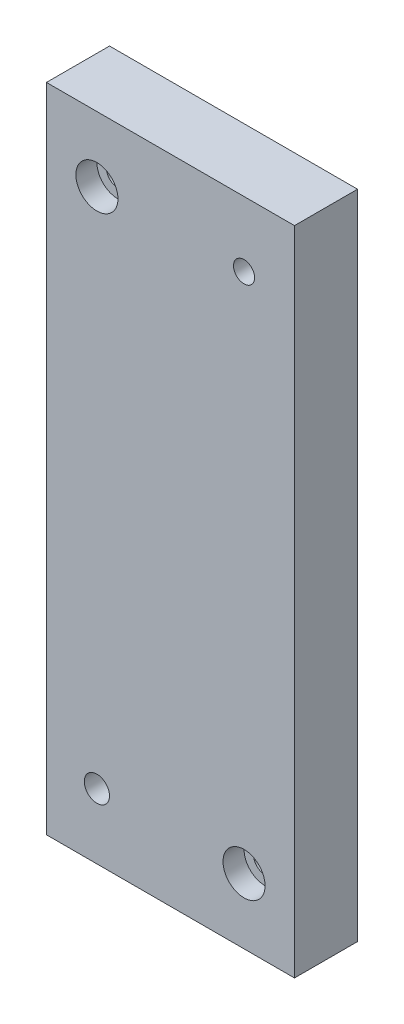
ISO-10303-21;
HEADER;
FILE_DESCRIPTION(('STEP AP214'),'2;1');
FILE_NAME('part.step','',(''),(''),'','','');
FILE_SCHEMA(('AUTOMOTIVE_DESIGN { 1 0 10303 214 1 1 1 1 }'));
ENDSEC;
DATA;
#1=APPLICATION_CONTEXT('core data for automotive mechanical design processes');
#2=APPLICATION_PROTOCOL_DEFINITION('international standard','automotive_design',2000,#1);
#3=PRODUCT_CONTEXT('',#1,'mechanical');
#4=PRODUCT('Part','Part','',(#3));
#5=PRODUCT_RELATED_PRODUCT_CATEGORY('part','',(#4));
#6=PRODUCT_DEFINITION_FORMATION('','',#4);
#7=PRODUCT_DEFINITION_CONTEXT('part definition',#1,'design');
#8=PRODUCT_DEFINITION('design','',#6,#7);
#9=PRODUCT_DEFINITION_SHAPE('','',#8);
#10=(LENGTH_UNIT() NAMED_UNIT(*) SI_UNIT(.MILLI.,.METRE.));
#11=(NAMED_UNIT(*) PLANE_ANGLE_UNIT() SI_UNIT($,.RADIAN.));
#12=(NAMED_UNIT(*) SI_UNIT($,.STERADIAN.) SOLID_ANGLE_UNIT());
#13=UNCERTAINTY_MEASURE_WITH_UNIT(LENGTH_MEASURE(1.E-05),#10,'distance_accuracy_value','');
#14=(GEOMETRIC_REPRESENTATION_CONTEXT(3) GLOBAL_UNCERTAINTY_ASSIGNED_CONTEXT((#13)) GLOBAL_UNIT_ASSIGNED_CONTEXT((#10,
#11,#12)) REPRESENTATION_CONTEXT('',''));
#15=CARTESIAN_POINT('',(0.,0.,0.));
#16=DIRECTION('',(0.,0.,1.));
#17=DIRECTION('',(1.,0.,0.));
#18=AXIS2_PLACEMENT_3D('',#15,#16,#17);
#19=CARTESIAN_POINT('',(-29.5,-77.5,15.));
#20=DIRECTION('',(0.,0.,1.));
#21=DIRECTION('',(1.,0.,0.));
#22=AXIS2_PLACEMENT_3D('',#19,#20,#21);
#23=PLANE('',#22);
#24=CARTESIAN_POINT('',(-17.4999999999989,61.9999999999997,15.));
#25=DIRECTION('',(0.,0.,1.));
#26=DIRECTION('',(1.,0.,0.));
#27=AXIS2_PLACEMENT_3D('',#24,#25,#26);
#28=CIRCLE('',#27,5.);
#29=CARTESIAN_POINT('',(-12.4999999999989,61.9999999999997,15.));
#30=VERTEX_POINT('',#29);
#31=EDGE_CURVE('E138',#30,#30,#28,.T.);
#32=ORIENTED_EDGE('',*,*,#31,.F.);
#33=EDGE_LOOP('',(#32));
#34=FACE_BOUND('',#33,.T.);
#35=CARTESIAN_POINT('',(17.5000000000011,-62.0000000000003,15.));
#36=DIRECTION('',(0.,0.,1.));
#37=DIRECTION('',(1.,0.,0.));
#38=AXIS2_PLACEMENT_3D('',#35,#36,#37);
#39=CIRCLE('',#38,5.);
#40=CARTESIAN_POINT('',(22.5000000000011,-62.0000000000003,15.));
#41=VERTEX_POINT('',#40);
#42=EDGE_CURVE('E124',#41,#41,#39,.T.);
#43=ORIENTED_EDGE('',*,*,#42,.F.);
#44=EDGE_LOOP('',(#43));
#45=FACE_BOUND('',#44,.T.);
#46=CARTESIAN_POINT('',(-17.4999999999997,-62.,15.));
#47=DIRECTION('',(0.,0.,1.));
#48=DIRECTION('',(1.,0.,0.));
#49=AXIS2_PLACEMENT_3D('',#46,#47,#48);
#50=CIRCLE('',#49,3.00349999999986);
#51=CARTESIAN_POINT('',(-14.4964999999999,-62.,15.));
#52=VERTEX_POINT('',#51);
#53=EDGE_CURVE('E90',#52,#52,#50,.T.);
#54=ORIENTED_EDGE('',*,*,#53,.F.);
#55=EDGE_LOOP('',(#54));
#56=FACE_BOUND('',#55,.T.);
#57=DIRECTION('',(1.,0.,0.));
#58=VECTOR('',#57,1.);
#59=CARTESIAN_POINT('',(-29.5,-77.5,15.));
#60=LINE('',#59,#58);
#61=CARTESIAN_POINT('',(-29.5,-77.5,15.));
#62=VERTEX_POINT('',#61);
#63=CARTESIAN_POINT('',(29.5,-77.5,15.));
#64=VERTEX_POINT('',#63);
#65=EDGE_CURVE('E100',#62,#64,#60,.T.);
#66=ORIENTED_EDGE('',*,*,#65,.T.);
#67=DIRECTION('',(0.,1.,0.));
#68=VECTOR('',#67,1.);
#69=CARTESIAN_POINT('',(29.5,-77.5,15.));
#70=LINE('',#69,#68);
#71=CARTESIAN_POINT('',(29.5,77.5,15.));
#72=VERTEX_POINT('',#71);
#73=EDGE_CURVE('E85',#64,#72,#70,.T.);
#74=ORIENTED_EDGE('',*,*,#73,.T.);
#75=DIRECTION('',(-1.,0.,0.));
#76=VECTOR('',#75,1.);
#77=CARTESIAN_POINT('',(29.5,77.5,15.));
#78=LINE('',#77,#76);
#79=CARTESIAN_POINT('',(-29.5,77.5,15.));
#80=VERTEX_POINT('',#79);
#81=EDGE_CURVE('E51',#72,#80,#78,.T.);
#82=ORIENTED_EDGE('',*,*,#81,.T.);
#83=DIRECTION('',(0.,-1.,0.));
#84=VECTOR('',#83,1.);
#85=CARTESIAN_POINT('',(-29.5,-77.5,15.));
#86=LINE('',#85,#84);
#87=EDGE_CURVE('E46',#80,#62,#86,.T.);
#88=ORIENTED_EDGE('',*,*,#87,.T.);
#89=EDGE_LOOP('',(#66,#74,#82,#88));
#90=FACE_BOUND('',#89,.T.);
#91=CARTESIAN_POINT('',(17.5000000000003,62.,15.));
#92=DIRECTION('',(0.,0.,1.));
#93=DIRECTION('',(1.,0.,0.));
#94=AXIS2_PLACEMENT_3D('',#91,#92,#93);
#95=CIRCLE('',#94,2.50349999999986);
#96=CARTESIAN_POINT('',(20.0035000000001,62.,15.));
#97=VERTEX_POINT('',#96);
#98=EDGE_CURVE('E118',#97,#97,#95,.T.);
#99=ORIENTED_EDGE('',*,*,#98,.F.);
#100=EDGE_LOOP('',(#99));
#101=FACE_BOUND('',#100,.T.);
#102=ADVANCED_FACE('F31',(#34,#45,#56,#90,#101),#23,.T.);
#103=CARTESIAN_POINT('',(-29.5,-77.5,0.));
#104=DIRECTION('',(0.,0.,1.));
#105=DIRECTION('',(1.,0.,0.));
#106=AXIS2_PLACEMENT_3D('',#103,#104,#105);
#107=PLANE('',#106);
#108=CARTESIAN_POINT('',(-17.4999999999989,61.9999999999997,0.));
#109=DIRECTION('',(0.,0.,1.));
#110=DIRECTION('',(1.,0.,0.));
#111=AXIS2_PLACEMENT_3D('',#108,#109,#110);
#112=CIRCLE('',#111,2.75);
#113=CARTESIAN_POINT('',(-14.7499999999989,61.9999999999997,0.));
#114=VERTEX_POINT('',#113);
#115=EDGE_CURVE('E147',#114,#114,#112,.T.);
#116=ORIENTED_EDGE('',*,*,#115,.T.);
#117=EDGE_LOOP('',(#116));
#118=FACE_BOUND('',#117,.T.);
#119=CARTESIAN_POINT('',(17.5000000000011,-62.0000000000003,0.));
#120=DIRECTION('',(0.,0.,1.));
#121=DIRECTION('',(1.,0.,0.));
#122=AXIS2_PLACEMENT_3D('',#119,#120,#121);
#123=CIRCLE('',#122,2.75);
#124=CARTESIAN_POINT('',(20.2500000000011,-62.0000000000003,0.));
#125=VERTEX_POINT('',#124);
#126=EDGE_CURVE('E135',#125,#125,#123,.T.);
#127=ORIENTED_EDGE('',*,*,#126,.T.);
#128=EDGE_LOOP('',(#127));
#129=FACE_BOUND('',#128,.T.);
#130=CARTESIAN_POINT('',(-17.4999999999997,-62.,0.));
#131=DIRECTION('',(0.,0.,1.));
#132=DIRECTION('',(1.,0.,0.));
#133=AXIS2_PLACEMENT_3D('',#130,#131,#132);
#134=CIRCLE('',#133,3.00349999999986);
#135=CARTESIAN_POINT('',(-14.4964999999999,-62.,0.));
#136=VERTEX_POINT('',#135);
#137=EDGE_CURVE('E93',#136,#136,#134,.T.);
#138=ORIENTED_EDGE('',*,*,#137,.T.);
#139=EDGE_LOOP('',(#138));
#140=FACE_BOUND('',#139,.T.);
#141=DIRECTION('',(1.,0.,0.));
#142=VECTOR('',#141,1.);
#143=CARTESIAN_POINT('',(-29.5,-77.5,0.));
#144=LINE('',#143,#142);
#145=CARTESIAN_POINT('',(-29.5,-77.5,0.));
#146=VERTEX_POINT('',#145);
#147=CARTESIAN_POINT('',(29.5,-77.5,0.));
#148=VERTEX_POINT('',#147);
#149=EDGE_CURVE('E77',#146,#148,#144,.T.);
#150=ORIENTED_EDGE('',*,*,#149,.F.);
#151=DIRECTION('',(0.,-1.,0.));
#152=VECTOR('',#151,1.);
#153=CARTESIAN_POINT('',(-29.5,-77.5,0.));
#154=LINE('',#153,#152);
#155=CARTESIAN_POINT('',(-29.5,77.5,0.));
#156=VERTEX_POINT('',#155);
#157=EDGE_CURVE('E98',#156,#146,#154,.T.);
#158=ORIENTED_EDGE('',*,*,#157,.F.);
#159=DIRECTION('',(-1.,0.,0.));
#160=VECTOR('',#159,1.);
#161=CARTESIAN_POINT('',(29.5,77.5,0.));
#162=LINE('',#161,#160);
#163=CARTESIAN_POINT('',(29.5,77.5,0.));
#164=VERTEX_POINT('',#163);
#165=EDGE_CURVE('E78',#164,#156,#162,.T.);
#166=ORIENTED_EDGE('',*,*,#165,.F.);
#167=DIRECTION('',(0.,1.,0.));
#168=VECTOR('',#167,1.);
#169=CARTESIAN_POINT('',(29.5,-77.5,0.));
#170=LINE('',#169,#168);
#171=EDGE_CURVE('E72',#148,#164,#170,.T.);
#172=ORIENTED_EDGE('',*,*,#171,.F.);
#173=EDGE_LOOP('',(#150,#158,#166,#172));
#174=FACE_BOUND('',#173,.T.);
#175=CARTESIAN_POINT('',(17.5000000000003,62.,0.));
#176=DIRECTION('',(0.,0.,1.));
#177=DIRECTION('',(1.,0.,0.));
#178=AXIS2_PLACEMENT_3D('',#175,#176,#177);
#179=CIRCLE('',#178,2.50349999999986);
#180=CARTESIAN_POINT('',(20.0035000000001,62.,0.));
#181=VERTEX_POINT('',#180);
#182=EDGE_CURVE('E120',#181,#181,#179,.T.);
#183=ORIENTED_EDGE('',*,*,#182,.T.);
#184=EDGE_LOOP('',(#183));
#185=FACE_BOUND('',#184,.T.);
#186=ADVANCED_FACE('F73',(#118,#129,#140,#174,#185),#107,.F.);
#187=CARTESIAN_POINT('',(-29.5,-77.5,15.));
#188=DIRECTION('',(0.,1.,0.));
#189=DIRECTION('',(-1.,0.,0.));
#190=AXIS2_PLACEMENT_3D('',#187,#188,#189);
#191=PLANE('',#190);
#192=ORIENTED_EDGE('',*,*,#149,.T.);
#193=DIRECTION('',(0.,0.,-1.));
#194=VECTOR('',#193,1.);
#195=CARTESIAN_POINT('',(29.5,-77.5,15.));
#196=LINE('',#195,#194);
#197=EDGE_CURVE('E11',#64,#148,#196,.T.);
#198=ORIENTED_EDGE('',*,*,#197,.F.);
#199=ORIENTED_EDGE('',*,*,#65,.F.);
#200=DIRECTION('',(0.,0.,-1.));
#201=VECTOR('',#200,1.);
#202=CARTESIAN_POINT('',(-29.5,-77.5,15.));
#203=LINE('',#202,#201);
#204=EDGE_CURVE('E89',#62,#146,#203,.T.);
#205=ORIENTED_EDGE('',*,*,#204,.T.);
#206=EDGE_LOOP('',(#192,#198,#199,#205));
#207=FACE_BOUND('',#206,.T.);
#208=ADVANCED_FACE('F33',(#207),#191,.F.);
#209=CARTESIAN_POINT('',(29.5,-77.5,15.));
#210=DIRECTION('',(-1.,0.,0.));
#211=DIRECTION('',(0.,-1.,0.));
#212=AXIS2_PLACEMENT_3D('',#209,#210,#211);
#213=PLANE('',#212);
#214=ORIENTED_EDGE('',*,*,#171,.T.);
#215=DIRECTION('',(0.,0.,-1.));
#216=VECTOR('',#215,1.);
#217=CARTESIAN_POINT('',(29.5,77.5,15.));
#218=LINE('',#217,#216);
#219=EDGE_CURVE('E39',#72,#164,#218,.T.);
#220=ORIENTED_EDGE('',*,*,#219,.F.);
#221=ORIENTED_EDGE('',*,*,#73,.F.);
#222=ORIENTED_EDGE('',*,*,#197,.T.);
#223=EDGE_LOOP('',(#214,#220,#221,#222));
#224=FACE_BOUND('',#223,.T.);
#225=ADVANCED_FACE('F84',(#224),#213,.F.);
#226=CARTESIAN_POINT('',(29.5,77.5,15.));
#227=DIRECTION('',(0.,-1.,0.));
#228=DIRECTION('',(1.,0.,0.));
#229=AXIS2_PLACEMENT_3D('',#226,#227,#228);
#230=PLANE('',#229);
#231=ORIENTED_EDGE('',*,*,#165,.T.);
#232=DIRECTION('',(0.,0.,-1.));
#233=VECTOR('',#232,1.);
#234=CARTESIAN_POINT('',(-29.5,77.5,15.));
#235=LINE('',#234,#233);
#236=EDGE_CURVE('E106',#80,#156,#235,.T.);
#237=ORIENTED_EDGE('',*,*,#236,.F.);
#238=ORIENTED_EDGE('',*,*,#81,.F.);
#239=ORIENTED_EDGE('',*,*,#219,.T.);
#240=EDGE_LOOP('',(#231,#237,#238,#239));
#241=FACE_BOUND('',#240,.T.);
#242=ADVANCED_FACE('F109',(#241),#230,.F.);
#243=CARTESIAN_POINT('',(-29.5,-77.5,15.));
#244=DIRECTION('',(1.,0.,0.));
#245=DIRECTION('',(0.,1.,0.));
#246=AXIS2_PLACEMENT_3D('',#243,#244,#245);
#247=PLANE('',#246);
#248=ORIENTED_EDGE('',*,*,#157,.T.);
#249=ORIENTED_EDGE('',*,*,#204,.F.);
#250=ORIENTED_EDGE('',*,*,#87,.F.);
#251=ORIENTED_EDGE('',*,*,#236,.T.);
#252=EDGE_LOOP('',(#248,#249,#250,#251));
#253=FACE_BOUND('',#252,.T.);
#254=ADVANCED_FACE('F111',(#253),#247,.F.);
#255=CARTESIAN_POINT('',(-17.4999999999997,-62.,15.));
#256=DIRECTION('',(0.,0.,-1.));
#257=DIRECTION('',(-1.,0.,0.));
#258=AXIS2_PLACEMENT_3D('',#255,#256,#257);
#259=CYLINDRICAL_SURFACE('',#258,3.00349999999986);
#260=ORIENTED_EDGE('',*,*,#53,.T.);
#261=EDGE_LOOP('',(#260));
#262=FACE_BOUND('',#261,.T.);
#263=ORIENTED_EDGE('',*,*,#137,.F.);
#264=EDGE_LOOP('',(#263));
#265=FACE_BOUND('',#264,.T.);
#266=ADVANCED_FACE('F176',(#262,#265),#259,.F.);
#267=CARTESIAN_POINT('',(17.5000000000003,62.,15.));
#268=DIRECTION('',(0.,0.,-1.));
#269=DIRECTION('',(-1.,0.,0.));
#270=AXIS2_PLACEMENT_3D('',#267,#268,#269);
#271=CYLINDRICAL_SURFACE('',#270,2.50349999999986);
#272=ORIENTED_EDGE('',*,*,#98,.T.);
#273=EDGE_LOOP('',(#272));
#274=FACE_BOUND('',#273,.T.);
#275=ORIENTED_EDGE('',*,*,#182,.F.);
#276=EDGE_LOOP('',(#275));
#277=FACE_BOUND('',#276,.T.);
#278=ADVANCED_FACE('F179',(#274,#277),#271,.F.);
#279=CARTESIAN_POINT('',(17.5000000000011,-62.0000000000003,15.));
#280=DIRECTION('',(0.,0.,1.));
#281=DIRECTION('',(1.,0.,0.));
#282=AXIS2_PLACEMENT_3D('',#279,#280,#281);
#283=CYLINDRICAL_SURFACE('',#282,5.);
#284=CARTESIAN_POINT('',(17.5000000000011,-62.0000000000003,10.));
#285=DIRECTION('',(0.,0.,1.));
#286=DIRECTION('',(1.,0.,0.));
#287=AXIS2_PLACEMENT_3D('',#284,#285,#286);
#288=CIRCLE('',#287,5.);
#289=CARTESIAN_POINT('',(22.5000000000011,-62.0000000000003,10.));
#290=VERTEX_POINT('',#289);
#291=EDGE_CURVE('E129',#290,#290,#288,.T.);
#292=ORIENTED_EDGE('',*,*,#291,.F.);
#293=EDGE_LOOP('',(#292));
#294=FACE_BOUND('',#293,.T.);
#295=ORIENTED_EDGE('',*,*,#42,.T.);
#296=EDGE_LOOP('',(#295));
#297=FACE_BOUND('',#296,.T.);
#298=ADVANCED_FACE('F216',(#294,#297),#283,.F.);
#299=CARTESIAN_POINT('',(20.2500000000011,-62.0000000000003,10.));
#300=DIRECTION('',(0.,0.,-1.));
#301=DIRECTION('',(-1.,0.,0.));
#302=AXIS2_PLACEMENT_3D('',#299,#300,#301);
#303=PLANE('',#302);
#304=CARTESIAN_POINT('',(17.5000000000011,-62.0000000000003,10.));
#305=DIRECTION('',(0.,0.,1.));
#306=DIRECTION('',(1.,0.,0.));
#307=AXIS2_PLACEMENT_3D('',#304,#305,#306);
#308=CIRCLE('',#307,2.75);
#309=CARTESIAN_POINT('',(20.2500000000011,-62.0000000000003,10.));
#310=VERTEX_POINT('',#309);
#311=EDGE_CURVE('E132',#310,#310,#308,.T.);
#312=ORIENTED_EDGE('',*,*,#311,.F.);
#313=EDGE_LOOP('',(#312));
#314=FACE_BOUND('',#313,.T.);
#315=ORIENTED_EDGE('',*,*,#291,.T.);
#316=EDGE_LOOP('',(#315));
#317=FACE_BOUND('',#316,.T.);
#318=ADVANCED_FACE('F223',(#314,#317),#303,.F.);
#319=CARTESIAN_POINT('',(17.5000000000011,-62.0000000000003,15.));
#320=DIRECTION('',(0.,0.,1.));
#321=DIRECTION('',(1.,0.,0.));
#322=AXIS2_PLACEMENT_3D('',#319,#320,#321);
#323=CYLINDRICAL_SURFACE('',#322,2.75);
#324=ORIENTED_EDGE('',*,*,#126,.F.);
#325=EDGE_LOOP('',(#324));
#326=FACE_BOUND('',#325,.T.);
#327=ORIENTED_EDGE('',*,*,#311,.T.);
#328=EDGE_LOOP('',(#327));
#329=FACE_BOUND('',#328,.T.);
#330=ADVANCED_FACE('F168',(#326,#329),#323,.F.);
#331=CARTESIAN_POINT('',(-17.4999999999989,61.9999999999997,15.));
#332=DIRECTION('',(0.,0.,1.));
#333=DIRECTION('',(1.,0.,0.));
#334=AXIS2_PLACEMENT_3D('',#331,#332,#333);
#335=CYLINDRICAL_SURFACE('',#334,5.);
#336=CARTESIAN_POINT('',(-17.4999999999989,61.9999999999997,10.));
#337=DIRECTION('',(0.,0.,1.));
#338=DIRECTION('',(1.,0.,0.));
#339=AXIS2_PLACEMENT_3D('',#336,#337,#338);
#340=CIRCLE('',#339,5.);
#341=CARTESIAN_POINT('',(-12.4999999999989,61.9999999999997,10.));
#342=VERTEX_POINT('',#341);
#343=EDGE_CURVE('E141',#342,#342,#340,.T.);
#344=ORIENTED_EDGE('',*,*,#343,.F.);
#345=EDGE_LOOP('',(#344));
#346=FACE_BOUND('',#345,.T.);
#347=ORIENTED_EDGE('',*,*,#31,.T.);
#348=EDGE_LOOP('',(#347));
#349=FACE_BOUND('',#348,.T.);
#350=ADVANCED_FACE('F162',(#346,#349),#335,.F.);
#351=CARTESIAN_POINT('',(-14.7499999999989,61.9999999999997,10.));
#352=DIRECTION('',(0.,0.,-1.));
#353=DIRECTION('',(-1.,0.,0.));
#354=AXIS2_PLACEMENT_3D('',#351,#352,#353);
#355=PLANE('',#354);
#356=CARTESIAN_POINT('',(-17.4999999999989,61.9999999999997,10.));
#357=DIRECTION('',(0.,0.,1.));
#358=DIRECTION('',(1.,0.,0.));
#359=AXIS2_PLACEMENT_3D('',#356,#357,#358);
#360=CIRCLE('',#359,2.75);
#361=CARTESIAN_POINT('',(-14.7499999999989,61.9999999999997,10.));
#362=VERTEX_POINT('',#361);
#363=EDGE_CURVE('E144',#362,#362,#360,.T.);
#364=ORIENTED_EDGE('',*,*,#363,.F.);
#365=EDGE_LOOP('',(#364));
#366=FACE_BOUND('',#365,.T.);
#367=ORIENTED_EDGE('',*,*,#343,.T.);
#368=EDGE_LOOP('',(#367));
#369=FACE_BOUND('',#368,.T.);
#370=ADVANCED_FACE('F156',(#366,#369),#355,.F.);
#371=CARTESIAN_POINT('',(-17.4999999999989,61.9999999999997,15.));
#372=DIRECTION('',(0.,0.,1.));
#373=DIRECTION('',(1.,0.,0.));
#374=AXIS2_PLACEMENT_3D('',#371,#372,#373);
#375=CYLINDRICAL_SURFACE('',#374,2.75);
#376=ORIENTED_EDGE('',*,*,#115,.F.);
#377=EDGE_LOOP('',(#376));
#378=FACE_BOUND('',#377,.T.);
#379=ORIENTED_EDGE('',*,*,#363,.T.);
#380=EDGE_LOOP('',(#379));
#381=FACE_BOUND('',#380,.T.);
#382=ADVANCED_FACE('F153',(#378,#381),#375,.F.);
#383=CLOSED_SHELL('',(#102,#186,#208,#225,#242,#254,#266,#278,#298,#318,#330,#350,#370,#382));
#384=MANIFOLD_SOLID_BREP('B2',#383);
#385=ADVANCED_BREP_SHAPE_REPRESENTATION('',(#18,#384),#14);
#386=SHAPE_DEFINITION_REPRESENTATION(#9,#385);
ENDSEC;
END-ISO-10303-21;
